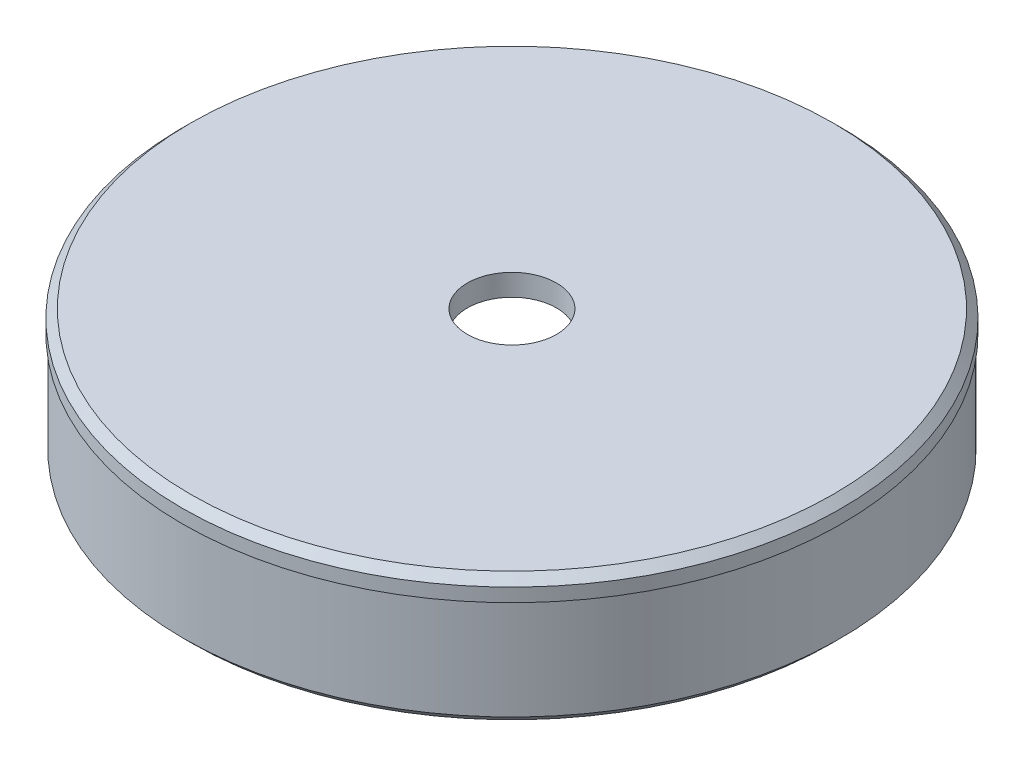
from build123d import *

# Parameters (mm, degrees)
SKETCH1_R           = 7.475
BOSS_EXTRUDE1_DEPTH = 4
SKETCH2_R           = 12.15
SKETCH2_R_2         = 10.15
BOSS_EXTRUDE2_DEPTH = 4
SKETCH3_R           = 12.2
BOSS_EXTRUDE3_DEPTH = 0.8
SKETCH4_R           = 8.294741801
CUT_EXTRUDE1_DEPTH  = 18.711013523
SKETCH5_R           = 1.65
CUT_EXTRUDE2_DEPTH  = 10
CHAMFER1_SIZE       = 0.3


with BuildPart() as part:
    # Sketch1 → Boss-Extrude1 (new body)
    with BuildSketch(Plane(origin=(0, 0, 0), x_dir=(1, 0, 0), z_dir=(0, 1, 0))):
        with Locations(Location((0, 0, 0), (0, 0, 270))):
            Circle(SKETCH1_R)
    extrude(amount=BOSS_EXTRUDE1_DEPTH)



with BuildPart() as body_2:
    # Sketch2 → Boss-Extrude2 (new body)
    with BuildSketch(Plane(origin=(0, 0, 0), x_dir=(1, 0, 0), z_dir=(0, 1, 0))):
        with Locations(Location((0, 0, 0), (0, 0, 270))):
            Circle(SKETCH2_R)
        with Locations(Location((0, 0, 0), (0, 0, 270))):
            Circle(SKETCH2_R_2, mode=Mode.SUBTRACT)
    extrude(amount=BOSS_EXTRUDE2_DEPTH)


with BuildPart() as part_1:
    add(part.part)

    add(body_2.part)  # Boss-Extrude3 merges body 2
    # Sketch3 → Boss-Extrude3 (add)
    with BuildSketch(Plane(origin=(0, 4, 0), x_dir=(1, 0, 0), z_dir=(0, 1, 0))):
        with Locations(Location((0, 0, 0), (0, 0, 270))):
            Circle(SKETCH3_R)
    extrude(amount=BOSS_EXTRUDE3_DEPTH)

    # Sketch4 → Cut-Extrude1 (cut, through all)
    with BuildSketch(Plane.XZ.offset(-4)):
        Circle(SKETCH4_R)
    extrude(amount=CUT_EXTRUDE1_DEPTH, mode=Mode.SUBTRACT)

    # Sketch5 → Cut-Extrude2 (cut)
    with BuildSketch(Plane.XZ.offset(-4)):
        with Locations(Location((0, 0, 0), (0, 0, 270))):
            Circle(SKETCH5_R)
    extrude(amount=-CUT_EXTRUDE2_DEPTH, mode=Mode.SUBTRACT)

    # Chamfer1
    chamfer1_edges = [part_1.edges().sort_by_distance(p)[0] for p in [
        (0, 4.8, -12.2),
        (0, 0, -10.15),
        (0, 0, -12.15),
        (0, 4, -10.15),
    ]]
    chamfer(chamfer1_edges, length=CHAMFER1_SIZE)


solid = part_1.part
